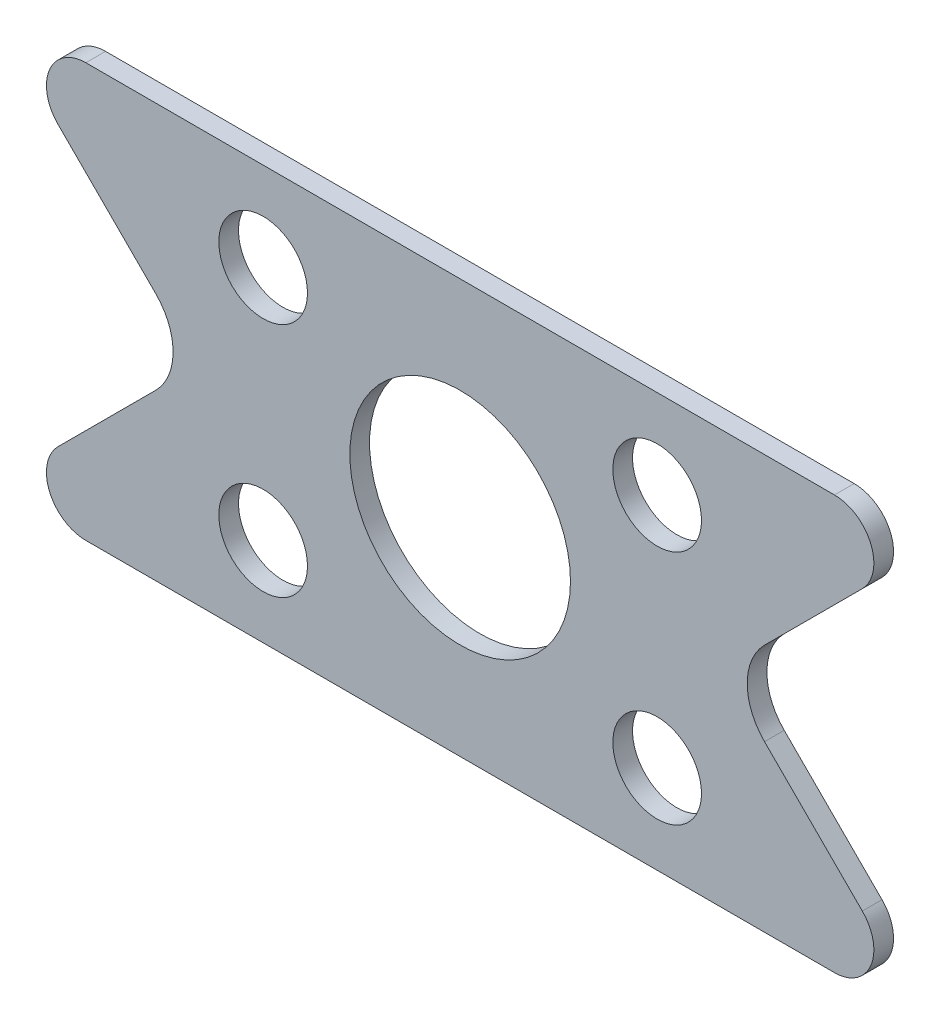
from build123d import *

# Parameters (mm, degrees)
ESQUISSE1_W             = 420
ESQUISSE1_H             = 210
ESQUISSE1_R             = 56
ESQUISSE1_R_2           = 22.5
EXTRUSION1_DEPTH        = 10
ENL_V_MAT_EXTRU_1_DEPTH = 10


with BuildPart() as part:
    # Esquisse1 → Extrusion1 (new body)
    with BuildSketch(Plane.XY):
        Rectangle(ESQUISSE1_W, ESQUISSE1_H)
        Circle(ESQUISSE1_R, mode=Mode.SUBTRACT)
        with Locations((100, 60)):
            Circle(ESQUISSE1_R_2, mode=Mode.SUBTRACT)
        with Locations((100, -60)):
            Circle(ESQUISSE1_R_2, mode=Mode.SUBTRACT)
        with Locations((-100, -60)):
            Circle(ESQUISSE1_R_2, mode=Mode.SUBTRACT)
        with Locations((-100, 60)):
            Circle(ESQUISSE1_R_2, mode=Mode.SUBTRACT)
    extrude(amount=EXTRUSION1_DEPTH)

    # Esquisse2 → Enl_v. mat.-Extru.1 (cut)
    with BuildSketch(Plane.XY.offset(10)):
        with BuildLine():
            Line((204.142135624, 70.857864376), (154.497474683, 21.213203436))
            ThreePointArc((154.497474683, 21.213203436), (145.710678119, 0), (154.497474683, -21.213203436))
            Line((154.497474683, -21.213203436), (204.142135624, -70.857864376))
            ThreePointArc((204.142135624, -70.857864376), (208.47759065, -92.653668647), (190, -105))
            Line((190, -105), (232.815198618, -105))
            Line((232.815198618, -105), (232.815198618, 105))
            Line((232.815198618, 105), (190, 105))
            ThreePointArc((190, 105), (208.47759065, 92.653668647), (204.142135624, 70.857864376))
        make_face()
    enl_v_mat_extru_1 = extrude(amount=-ENL_V_MAT_EXTRU_1_DEPTH, mode=Mode.SUBTRACT)

    # Sym_trie1: Enl_v. mat.-Extru.1 across plane
    add(enl_v_mat_extru_1.mirror(Plane(origin=(0, 0, 0), x_dir=(0, 0, 1), z_dir=(1, 0, 0))), mode=Mode.SUBTRACT)


solid = part.part
